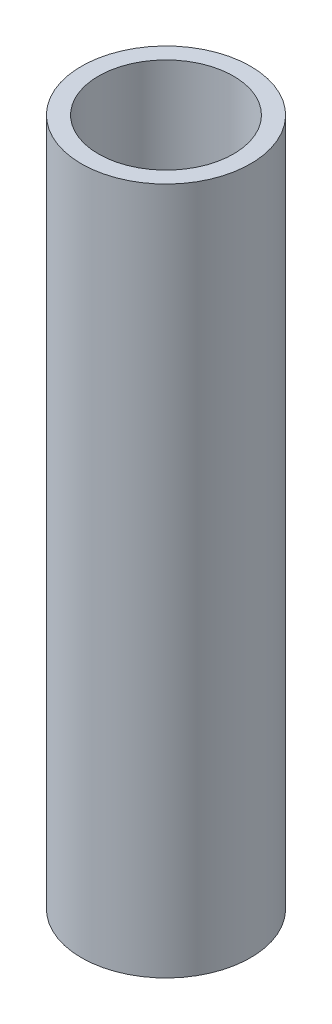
from build123d import *

# Parameters (mm, degrees)
SKETCH1_R      = 12.809792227
EXTRUDE1_DEPTH = 2.54
SKETCH2_R      = 12.809792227
SKETCH2_R_2    = 10.227329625
EXTRUDE2_DEPTH = 101.6


with BuildPart() as part:
    # Sketch1 → Extrude1 (new body)
    with BuildSketch(Plane(origin=(0, 0, 0), x_dir=(1, 0, 0), z_dir=(0, 1, 0))):
        with Locations(Location((0, 0, 0), (0, 0, 270))):
            Circle(SKETCH1_R)
    extrude(amount=EXTRUDE1_DEPTH)

    # Sketch2 → Extrude2 (add)
    with BuildSketch(Plane(origin=(0, 2.54, 0), x_dir=(1, 0, 0), z_dir=(0, 1, 0))):
        with Locations(Location((0, 0, 0), (0, 0, 270))):
            Circle(SKETCH2_R)
        with Locations(Location((0, 0, 0), (0, 0, 270))):
            Circle(SKETCH2_R_2, mode=Mode.SUBTRACT)
    extrude(amount=EXTRUDE2_DEPTH)


solid = part.part
